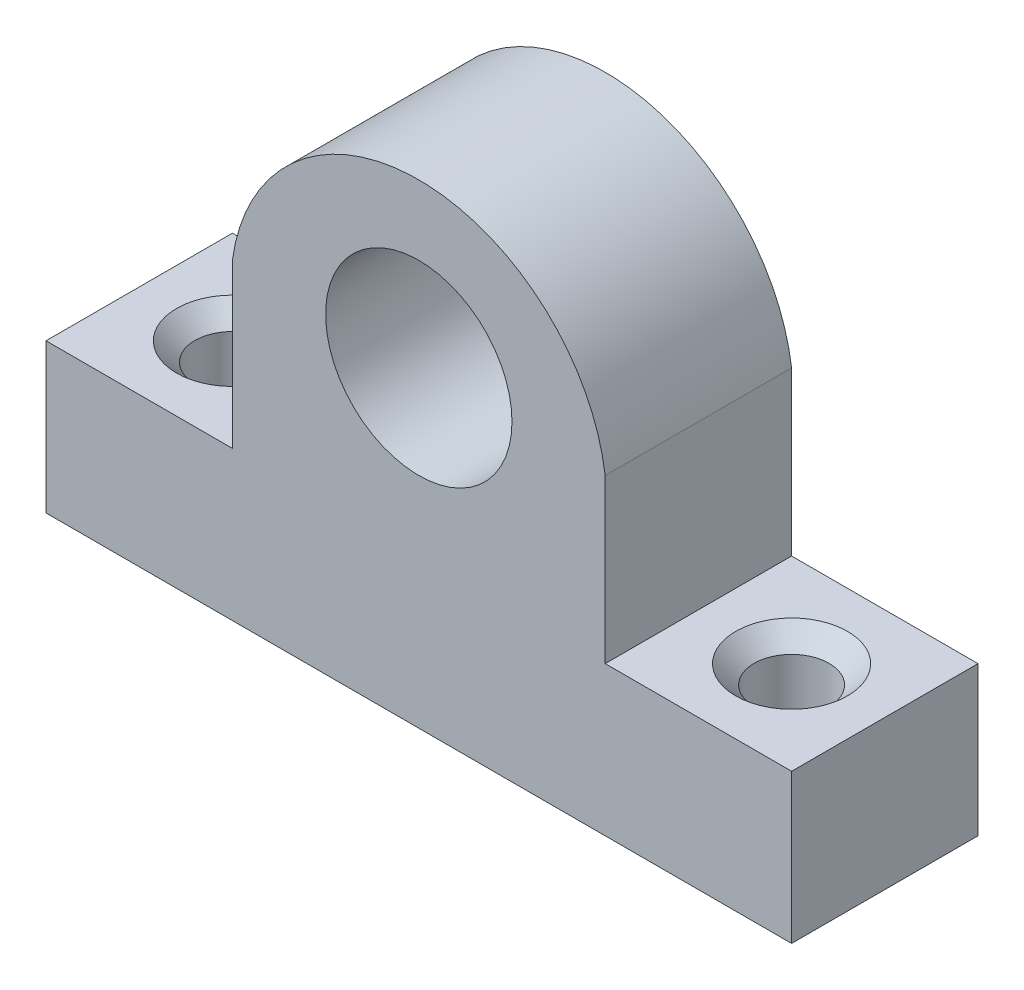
from build123d import *

# Parameters (mm, degrees)
SKETCH2_W                         = 50.8
SKETCH2_H                         = 10.16
SKETCH2_W_2                       = 25.4
SKETCH2_H_2                       = 22.1996
BOSS_EXTRUDE1_DEPTH               = 12.7
CUT_EXTRUDE3_DEPTH                = 62.555452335
CUT_EXTRUDE3_DEPTH_BACK           = 62.555452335
CUT_EXTRUDE4_DEPTH                = 62.555452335
CUT_EXTRUDE4_DEPTH_BACK           = 62.555452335
SKETCH9_R                         = 6.35
F_1_4_20_TAPPED_HOLE2_D           = 5.1054
F_1_4_20_TAPPED_HOLE2_CSINK_D     = 7.62
F_1_4_20_TAPPED_HOLE2_CSINK_ANGLE = 90


with BuildPart() as part:
    # Sketch2 → Boss-Extrude1 (new body)
    with BuildSketch(Plane.XY):
        with Locations((25.4, 5.08)):
            Rectangle(SKETCH2_W, SKETCH2_H)
        with Locations((25.4, 21.2598)):
            Rectangle(SKETCH2_W_2, SKETCH2_H_2)
    extrude(amount=BOSS_EXTRUDE1_DEPTH)

    # Sketch8 → Cut-Extrude3 (cut, two sides: drawn at the far end of the back side and taken through both)
    with BuildSketch(Plane.XY.offset(12.7).offset(-CUT_EXTRUDE3_DEPTH_BACK)):
        with BuildLine():
            Line((12.7, 21.2598), (12.7, 33.620854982))
            Line((12.7, 33.620854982), (38.1, 33.620854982))
            Line((38.1, 33.620854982), (38.1, 21.2598))
            ThreePointArc((38.1, 21.2598), (25.4, 32.3596), (12.7, 21.2598))
        make_face()
    extrude(amount=CUT_EXTRUDE3_DEPTH + CUT_EXTRUDE3_DEPTH_BACK, mode=Mode.SUBTRACT)

    # Sketch9 → Cut-Extrude4 (cut, two sides: drawn at the far end of the back side and taken through both)
    with BuildSketch(Plane.XY.offset(12.7).offset(-CUT_EXTRUDE4_DEPTH_BACK)):
        with Locations((25.4, 21.2598)):
            Circle(SKETCH9_R)
    extrude(amount=CUT_EXTRUDE4_DEPTH + CUT_EXTRUDE4_DEPTH_BACK, mode=Mode.SUBTRACT)

    # 1_4-20 Tapped Hole2 (through all)
    with Locations(Plane(origin=(0, 10.16, 0), x_dir=(1, 0, 0), z_dir=(0, 1, 0))):
        with Locations((6.35, -6.35), (44.45, -6.35)):
            CounterSinkHole(F_1_4_20_TAPPED_HOLE2_D / 2, F_1_4_20_TAPPED_HOLE2_CSINK_D / 2, counter_sink_angle=F_1_4_20_TAPPED_HOLE2_CSINK_ANGLE)


solid = part.part
